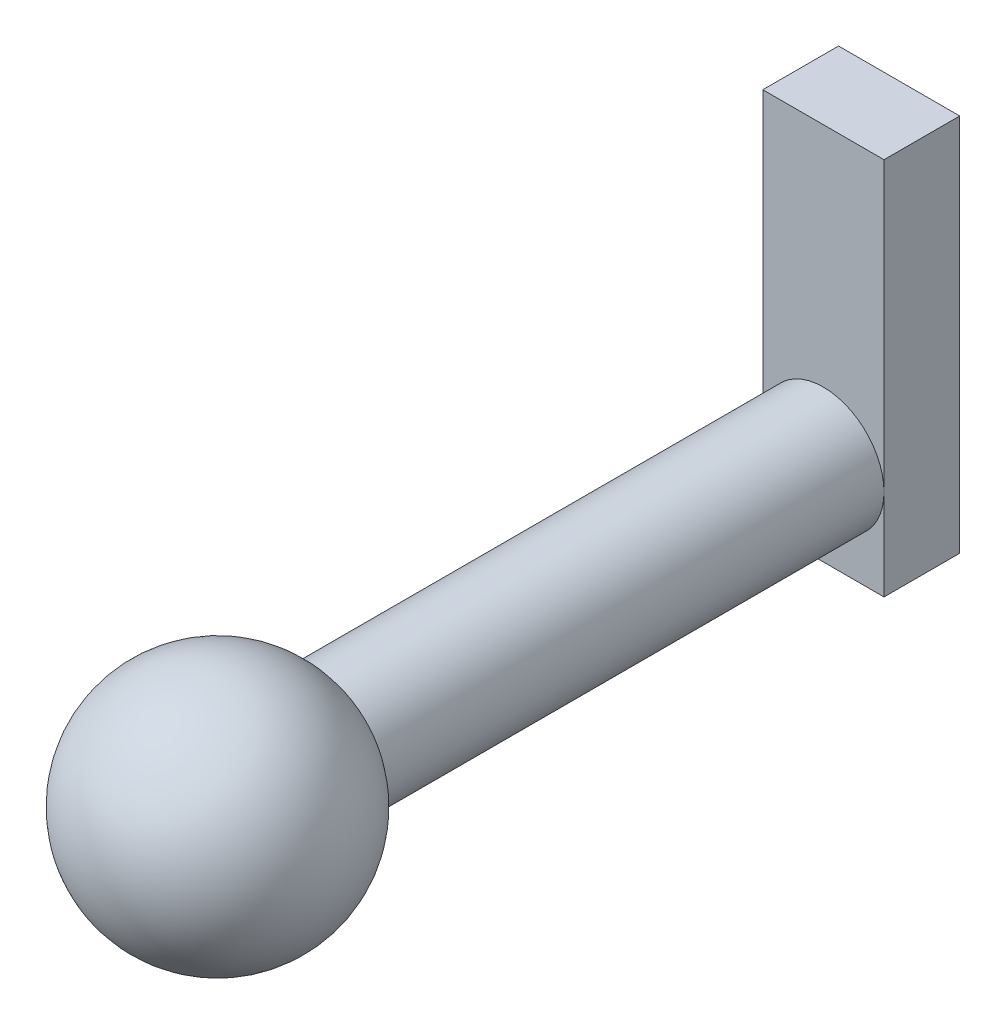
ISO-10303-21;
HEADER;
FILE_DESCRIPTION(('STEP AP214'),'2;1');
FILE_NAME('part.step','',(''),(''),'','','');
FILE_SCHEMA(('AUTOMOTIVE_DESIGN { 1 0 10303 214 1 1 1 1 }'));
ENDSEC;
DATA;
#1=APPLICATION_CONTEXT('core data for automotive mechanical design processes');
#2=APPLICATION_PROTOCOL_DEFINITION('international standard','automotive_design',2000,#1);
#3=PRODUCT_CONTEXT('',#1,'mechanical');
#4=PRODUCT('Part','Part','',(#3));
#5=PRODUCT_RELATED_PRODUCT_CATEGORY('part','',(#4));
#6=PRODUCT_DEFINITION_FORMATION('','',#4);
#7=PRODUCT_DEFINITION_CONTEXT('part definition',#1,'design');
#8=PRODUCT_DEFINITION('design','',#6,#7);
#9=PRODUCT_DEFINITION_SHAPE('','',#8);
#10=(LENGTH_UNIT() NAMED_UNIT(*) SI_UNIT(.MILLI.,.METRE.));
#11=(NAMED_UNIT(*) PLANE_ANGLE_UNIT() SI_UNIT($,.RADIAN.));
#12=(NAMED_UNIT(*) SI_UNIT($,.STERADIAN.) SOLID_ANGLE_UNIT());
#13=UNCERTAINTY_MEASURE_WITH_UNIT(LENGTH_MEASURE(1.E-05),#10,'distance_accuracy_value','');
#14=(GEOMETRIC_REPRESENTATION_CONTEXT(3) GLOBAL_UNCERTAINTY_ASSIGNED_CONTEXT((#13)) GLOBAL_UNIT_ASSIGNED_CONTEXT((#10,
#11,#12)) REPRESENTATION_CONTEXT('',''));
#15=CARTESIAN_POINT('',(0.,0.,0.));
#16=DIRECTION('',(0.,0.,1.));
#17=DIRECTION('',(1.,0.,0.));
#18=AXIS2_PLACEMENT_3D('',#15,#16,#17);
#19=CARTESIAN_POINT('',(0.,0.,80.));
#20=DIRECTION('',(0.,0.,-1.));
#21=DIRECTION('',(-1.,0.,0.));
#22=AXIS2_PLACEMENT_3D('',#19,#20,#21);
#23=CYLINDRICAL_SURFACE('',#22,8.);
#24=CARTESIAN_POINT('',(0.,0.,0.));
#25=DIRECTION('',(0.,0.,1.));
#26=DIRECTION('',(1.,0.,0.));
#27=AXIS2_PLACEMENT_3D('',#24,#25,#26);
#28=CIRCLE('',#27,8.);
#29=CARTESIAN_POINT('',(8.,0.,0.));
#30=VERTEX_POINT('',#29);
#31=CARTESIAN_POINT('',(-8.,0.,0.));
#32=VERTEX_POINT('',#31);
#33=EDGE_CURVE('E39',#30,#32,#28,.T.);
#34=ORIENTED_EDGE('',*,*,#33,.T.);
#35=EDGE_CURVE('E53',#32,#30,#28,.T.);
#36=ORIENTED_EDGE('',*,*,#35,.T.);
#37=EDGE_LOOP('',(#34,#36));
#38=FACE_BOUND('',#37,.T.);
#39=CARTESIAN_POINT('',(0.,0.,66.143593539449));
#40=DIRECTION('',(0.,0.,1.));
#41=DIRECTION('',(1.,0.,0.));
#42=AXIS2_PLACEMENT_3D('',#39,#40,#41);
#43=CIRCLE('',#42,8.);
#44=CARTESIAN_POINT('',(8.,0.,66.143593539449));
#45=VERTEX_POINT('',#44);
#46=EDGE_CURVE('E11',#45,#45,#43,.T.);
#47=ORIENTED_EDGE('',*,*,#46,.F.);
#48=EDGE_LOOP('',(#47));
#49=FACE_BOUND('',#48,.T.);
#50=ADVANCED_FACE('F32',(#38,#49),#23,.T.);
#51=CARTESIAN_POINT('',(8.,38.,0.));
#52=DIRECTION('',(0.,0.,1.));
#53=DIRECTION('',(1.,0.,0.));
#54=AXIS2_PLACEMENT_3D('',#51,#52,#53);
#55=PLANE('',#54);
#56=ORIENTED_EDGE('',*,*,#33,.F.);
#57=DIRECTION('',(0.,-1.,0.));
#58=VECTOR('',#57,1.);
#59=CARTESIAN_POINT('',(8.,-12.,0.));
#60=LINE('',#59,#58);
#61=CARTESIAN_POINT('',(8.,38.,0.));
#62=VERTEX_POINT('',#61);
#63=EDGE_CURVE('E46',#62,#30,#60,.T.);
#64=ORIENTED_EDGE('',*,*,#63,.F.);
#65=DIRECTION('',(1.,0.,0.));
#66=VECTOR('',#65,1.);
#67=CARTESIAN_POINT('',(8.,38.,0.));
#68=LINE('',#67,#66);
#69=CARTESIAN_POINT('',(-8.,38.,0.));
#70=VERTEX_POINT('',#69);
#71=EDGE_CURVE('E97',#70,#62,#68,.T.);
#72=ORIENTED_EDGE('',*,*,#71,.F.);
#73=DIRECTION('',(0.,1.,0.));
#74=VECTOR('',#73,1.);
#75=CARTESIAN_POINT('',(-8.,-12.,0.));
#76=LINE('',#75,#74);
#77=EDGE_CURVE('E113',#32,#70,#76,.T.);
#78=ORIENTED_EDGE('',*,*,#77,.F.);
#79=EDGE_LOOP('',(#56,#64,#72,#78));
#80=FACE_BOUND('',#79,.T.);
#81=ADVANCED_FACE('F111',(#80),#55,.T.);
#82=ORIENTED_EDGE('',*,*,#35,.F.);
#83=CARTESIAN_POINT('',(-8.,-12.,0.));
#84=VERTEX_POINT('',#83);
#85=EDGE_CURVE('E118',#84,#32,#76,.T.);
#86=ORIENTED_EDGE('',*,*,#85,.F.);
#87=DIRECTION('',(-1.,0.,0.));
#88=VECTOR('',#87,1.);
#89=CARTESIAN_POINT('',(8.,-12.,0.));
#90=LINE('',#89,#88);
#91=CARTESIAN_POINT('',(8.,-12.,0.));
#92=VERTEX_POINT('',#91);
#93=EDGE_CURVE('E119',#92,#84,#90,.T.);
#94=ORIENTED_EDGE('',*,*,#93,.F.);
#95=EDGE_CURVE('E100',#30,#92,#60,.T.);
#96=ORIENTED_EDGE('',*,*,#95,.F.);
#97=EDGE_LOOP('',(#82,#86,#94,#96));
#98=FACE_BOUND('',#97,.T.);
#99=ADVANCED_FACE('F131',(#98),#55,.T.);
#100=CARTESIAN_POINT('',(8.,-12.,-10.));
#101=DIRECTION('',(-1.,0.,0.));
#102=DIRECTION('',(0.,0.,1.));
#103=AXIS2_PLACEMENT_3D('',#100,#101,#102);
#104=PLANE('',#103);
#105=ORIENTED_EDGE('',*,*,#63,.T.);
#106=ORIENTED_EDGE('',*,*,#95,.T.);
#107=DIRECTION('',(0.,0.,1.));
#108=VECTOR('',#107,1.);
#109=CARTESIAN_POINT('',(8.,-12.,-10.));
#110=LINE('',#109,#108);
#111=CARTESIAN_POINT('',(8.,-12.,-10.));
#112=VERTEX_POINT('',#111);
#113=EDGE_CURVE('E84',#112,#92,#110,.T.);
#114=ORIENTED_EDGE('',*,*,#113,.F.);
#115=DIRECTION('',(0.,-1.,0.));
#116=VECTOR('',#115,1.);
#117=CARTESIAN_POINT('',(8.,-12.,-10.));
#118=LINE('',#117,#116);
#119=CARTESIAN_POINT('',(8.,38.,-10.));
#120=VERTEX_POINT('',#119);
#121=EDGE_CURVE('E90',#120,#112,#118,.T.);
#122=ORIENTED_EDGE('',*,*,#121,.F.);
#123=DIRECTION('',(0.,0.,1.));
#124=VECTOR('',#123,1.);
#125=CARTESIAN_POINT('',(8.,38.,-10.));
#126=LINE('',#125,#124);
#127=EDGE_CURVE('E126',#120,#62,#126,.T.);
#128=ORIENTED_EDGE('',*,*,#127,.T.);
#129=EDGE_LOOP('',(#105,#106,#114,#122,#128));
#130=FACE_BOUND('',#129,.T.);
#131=ADVANCED_FACE('F99',(#130),#104,.F.);
#132=CARTESIAN_POINT('',(8.,-12.,-10.));
#133=DIRECTION('',(0.,1.,0.));
#134=DIRECTION('',(0.,0.,1.));
#135=AXIS2_PLACEMENT_3D('',#132,#133,#134);
#136=PLANE('',#135);
#137=ORIENTED_EDGE('',*,*,#93,.T.);
#138=DIRECTION('',(0.,0.,1.));
#139=VECTOR('',#138,1.);
#140=CARTESIAN_POINT('',(-8.,-12.,-10.));
#141=LINE('',#140,#139);
#142=CARTESIAN_POINT('',(-8.,-12.,-10.));
#143=VERTEX_POINT('',#142);
#144=EDGE_CURVE('E86',#143,#84,#141,.T.);
#145=ORIENTED_EDGE('',*,*,#144,.F.);
#146=DIRECTION('',(-1.,0.,0.));
#147=VECTOR('',#146,1.);
#148=CARTESIAN_POINT('',(8.,-12.,-10.));
#149=LINE('',#148,#147);
#150=EDGE_CURVE('E80',#112,#143,#149,.T.);
#151=ORIENTED_EDGE('',*,*,#150,.F.);
#152=ORIENTED_EDGE('',*,*,#113,.T.);
#153=EDGE_LOOP('',(#137,#145,#151,#152));
#154=FACE_BOUND('',#153,.T.);
#155=ADVANCED_FACE('F82',(#154),#136,.F.);
#156=CARTESIAN_POINT('',(-8.,-12.,-10.));
#157=DIRECTION('',(1.,0.,0.));
#158=DIRECTION('',(0.,0.,-1.));
#159=AXIS2_PLACEMENT_3D('',#156,#157,#158);
#160=PLANE('',#159);
#161=ORIENTED_EDGE('',*,*,#85,.T.);
#162=ORIENTED_EDGE('',*,*,#77,.T.);
#163=DIRECTION('',(0.,0.,1.));
#164=VECTOR('',#163,1.);
#165=CARTESIAN_POINT('',(-8.,38.,-10.));
#166=LINE('',#165,#164);
#167=CARTESIAN_POINT('',(-8.,38.,-10.));
#168=VERTEX_POINT('',#167);
#169=EDGE_CURVE('E103',#168,#70,#166,.T.);
#170=ORIENTED_EDGE('',*,*,#169,.F.);
#171=DIRECTION('',(0.,1.,0.));
#172=VECTOR('',#171,1.);
#173=CARTESIAN_POINT('',(-8.,-12.,-10.));
#174=LINE('',#173,#172);
#175=EDGE_CURVE('E89',#143,#168,#174,.T.);
#176=ORIENTED_EDGE('',*,*,#175,.F.);
#177=ORIENTED_EDGE('',*,*,#144,.T.);
#178=EDGE_LOOP('',(#161,#162,#170,#176,#177));
#179=FACE_BOUND('',#178,.T.);
#180=ADVANCED_FACE('F121',(#179),#160,.F.);
#181=CARTESIAN_POINT('',(8.,38.,-10.));
#182=DIRECTION('',(0.,-1.,0.));
#183=DIRECTION('',(0.,0.,-1.));
#184=AXIS2_PLACEMENT_3D('',#181,#182,#183);
#185=PLANE('',#184);
#186=ORIENTED_EDGE('',*,*,#71,.T.);
#187=ORIENTED_EDGE('',*,*,#127,.F.);
#188=DIRECTION('',(1.,0.,0.));
#189=VECTOR('',#188,1.);
#190=CARTESIAN_POINT('',(8.,38.,-10.));
#191=LINE('',#190,#189);
#192=EDGE_CURVE('E95',#168,#120,#191,.T.);
#193=ORIENTED_EDGE('',*,*,#192,.F.);
#194=ORIENTED_EDGE('',*,*,#169,.T.);
#195=EDGE_LOOP('',(#186,#187,#193,#194));
#196=FACE_BOUND('',#195,.T.);
#197=ADVANCED_FACE('F128',(#196),#185,.F.);
#198=CARTESIAN_POINT('',(8.,38.,-10.));
#199=DIRECTION('',(0.,0.,1.));
#200=DIRECTION('',(1.,0.,0.));
#201=AXIS2_PLACEMENT_3D('',#198,#199,#200);
#202=PLANE('',#201);
#203=ORIENTED_EDGE('',*,*,#121,.T.);
#204=ORIENTED_EDGE('',*,*,#150,.T.);
#205=ORIENTED_EDGE('',*,*,#175,.T.);
#206=ORIENTED_EDGE('',*,*,#192,.T.);
#207=EDGE_LOOP('',(#203,#204,#205,#206));
#208=FACE_BOUND('',#207,.T.);
#209=ADVANCED_FACE('F93',(#208),#202,.F.);
#210=CARTESIAN_POINT('',(0.,0.,80.));
#211=DIRECTION('',(0.,1.,0.));
#212=DIRECTION('',(1.,0.,0.));
#213=AXIS2_PLACEMENT_3D('',#210,#211,#212);
#214=SPHERICAL_SURFACE('',#213,16.);
#215=CARTESIAN_POINT('',(0.,0.,80.));
#216=DIRECTION('',(0.,0.,1.));
#217=DIRECTION('',(1.,0.,0.));
#218=AXIS2_PLACEMENT_3D('',#215,#216,#217);
#219=SPHERICAL_SURFACE('',#218,16.);
#220=ORIENTED_EDGE('',*,*,#46,.T.);
#221=EDGE_LOOP('',(#220));
#222=FACE_BOUND('',#221,.T.);
#223=ADVANCED_FACE('F189',(#222),#219,.T.);
#224=CLOSED_SHELL('',(#50,#81,#99,#131,#155,#180,#197,#209,#223));
#225=MANIFOLD_SOLID_BREP('B2',#224);
#226=ADVANCED_BREP_SHAPE_REPRESENTATION('',(#18,#225),#14);
#227=SHAPE_DEFINITION_REPRESENTATION(#9,#226);
ENDSEC;
END-ISO-10303-21;
